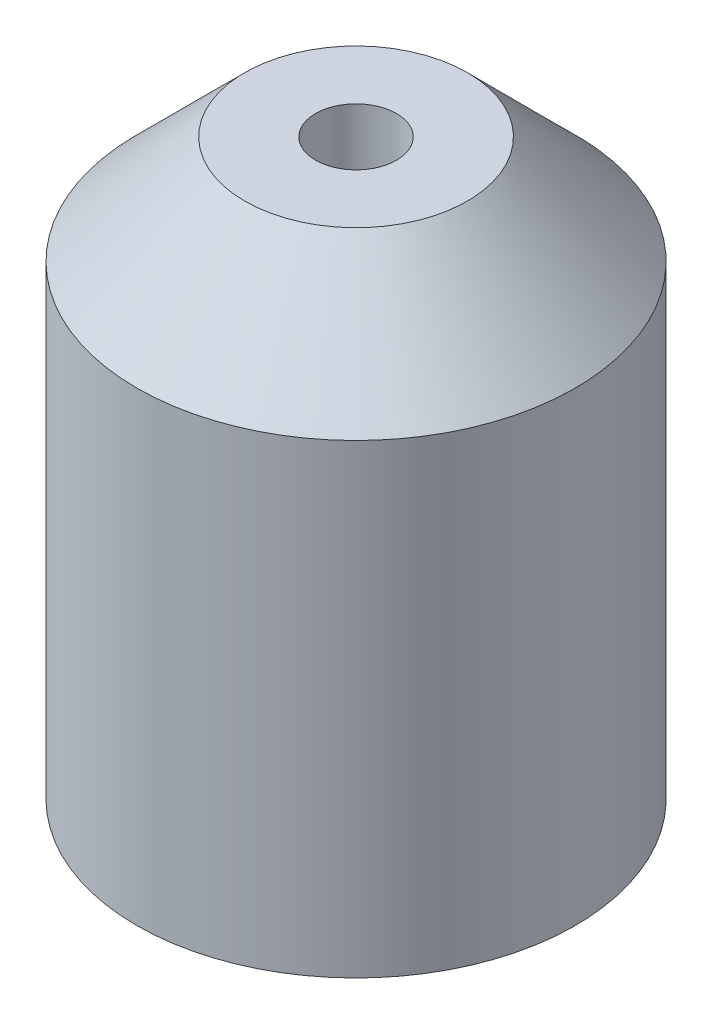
ISO-10303-21;
HEADER;
FILE_DESCRIPTION(('STEP AP214'),'2;1');
FILE_NAME('part.step','',(''),(''),'','','');
FILE_SCHEMA(('AUTOMOTIVE_DESIGN { 1 0 10303 214 1 1 1 1 }'));
ENDSEC;
DATA;
#1=APPLICATION_CONTEXT('core data for automotive mechanical design processes');
#2=APPLICATION_PROTOCOL_DEFINITION('international standard','automotive_design',2000,#1);
#3=PRODUCT_CONTEXT('',#1,'mechanical');
#4=PRODUCT('Part','Part','',(#3));
#5=PRODUCT_RELATED_PRODUCT_CATEGORY('part','',(#4));
#6=PRODUCT_DEFINITION_FORMATION('','',#4);
#7=PRODUCT_DEFINITION_CONTEXT('part definition',#1,'design');
#8=PRODUCT_DEFINITION('design','',#6,#7);
#9=PRODUCT_DEFINITION_SHAPE('','',#8);
#10=(LENGTH_UNIT() NAMED_UNIT(*) SI_UNIT(.MILLI.,.METRE.));
#11=(NAMED_UNIT(*) PLANE_ANGLE_UNIT() SI_UNIT($,.RADIAN.));
#12=(NAMED_UNIT(*) SI_UNIT($,.STERADIAN.) SOLID_ANGLE_UNIT());
#13=UNCERTAINTY_MEASURE_WITH_UNIT(LENGTH_MEASURE(1.E-05),#10,'distance_accuracy_value','');
#14=(GEOMETRIC_REPRESENTATION_CONTEXT(3) GLOBAL_UNCERTAINTY_ASSIGNED_CONTEXT((#13)) GLOBAL_UNIT_ASSIGNED_CONTEXT((#10,
#11,#12)) REPRESENTATION_CONTEXT('',''));
#15=CARTESIAN_POINT('',(0.,0.,0.));
#16=DIRECTION('',(0.,0.,1.));
#17=DIRECTION('',(1.,0.,0.));
#18=AXIS2_PLACEMENT_3D('',#15,#16,#17);
#19=CARTESIAN_POINT('',(0.,0.,43.18));
#20=DIRECTION('',(0.,1.,0.));
#21=DIRECTION('',(0.,0.,1.));
#22=AXIS2_PLACEMENT_3D('',#19,#20,#21);
#23=PLANE('',#22);
#24=CARTESIAN_POINT('',(0.,0.,43.18));
#25=DIRECTION('',(0.,1.,0.));
#26=DIRECTION('',(0.,0.,1.));
#27=AXIS2_PLACEMENT_3D('',#24,#25,#26);
#28=CIRCLE('',#27,14.2269848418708);
#29=CARTESIAN_POINT('',(0.,0.,57.4069848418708));
#30=VERTEX_POINT('',#29);
#31=EDGE_CURVE('E65',#30,#30,#28,.T.);
#32=ORIENTED_EDGE('',*,*,#31,.T.);
#33=EDGE_LOOP('',(#32));
#34=FACE_BOUND('',#33,.T.);
#35=CARTESIAN_POINT('',(0.,0.,43.18));
#36=DIRECTION('',(0.,1.,0.));
#37=DIRECTION('',(0.,0.,1.));
#38=AXIS2_PLACEMENT_3D('',#35,#36,#37);
#39=CIRCLE('',#38,20.6375);
#40=CARTESIAN_POINT('',(0.,0.,63.8175));
#41=VERTEX_POINT('',#40);
#42=EDGE_CURVE('E123',#41,#41,#39,.T.);
#43=ORIENTED_EDGE('',*,*,#42,.F.);
#44=EDGE_LOOP('',(#43));
#45=FACE_BOUND('',#44,.T.);
#46=ADVANCED_FACE('F50',(#34,#45),#23,.F.);
#47=CARTESIAN_POINT('',(0.,53.975,43.18));
#48=DIRECTION('',(0.,-1.,0.));
#49=DIRECTION('',(0.,0.,-1.));
#50=AXIS2_PLACEMENT_3D('',#47,#48,#49);
#51=CYLINDRICAL_SURFACE('',#50,3.81);
#52=CARTESIAN_POINT('',(0.,53.975,43.18));
#53=DIRECTION('',(0.,1.,0.));
#54=DIRECTION('',(0.,0.,1.));
#55=AXIS2_PLACEMENT_3D('',#52,#53,#54);
#56=CIRCLE('',#55,3.81);
#57=CARTESIAN_POINT('',(0.,53.975,46.99));
#58=VERTEX_POINT('',#57);
#59=EDGE_CURVE('E125',#58,#58,#56,.T.);
#60=ORIENTED_EDGE('',*,*,#59,.T.);
#61=EDGE_LOOP('',(#60));
#62=FACE_BOUND('',#61,.T.);
#63=CARTESIAN_POINT('',(0.,45.1885840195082,43.1799999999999));
#64=DIRECTION('',(0.,-1.,0.));
#65=DIRECTION('',(0.,0.,-1.));
#66=AXIS2_PLACEMENT_3D('',#63,#64,#65);
#67=CIRCLE('',#66,3.81);
#68=CARTESIAN_POINT('',(0.,45.1885840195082,39.3699999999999));
#69=VERTEX_POINT('',#68);
#70=EDGE_CURVE('E128',#69,#69,#67,.T.);
#71=ORIENTED_EDGE('',*,*,#70,.T.);
#72=EDGE_LOOP('',(#71));
#73=FACE_BOUND('',#72,.T.);
#74=ADVANCED_FACE('F112',(#62,#73),#51,.F.);
#75=CARTESIAN_POINT('',(0.,53.975,43.18));
#76=DIRECTION('',(0.,1.,0.));
#77=DIRECTION('',(0.,0.,1.));
#78=AXIS2_PLACEMENT_3D('',#75,#76,#77);
#79=PLANE('',#78);
#80=CARTESIAN_POINT('',(0.,53.975,43.18));
#81=DIRECTION('',(0.,1.,0.));
#82=DIRECTION('',(0.,0.,1.));
#83=AXIS2_PLACEMENT_3D('',#80,#81,#82);
#84=CIRCLE('',#83,10.4775);
#85=CARTESIAN_POINT('',(0.,53.975,53.6575));
#86=VERTEX_POINT('',#85);
#87=EDGE_CURVE('E57',#86,#86,#84,.T.);
#88=ORIENTED_EDGE('',*,*,#87,.T.);
#89=EDGE_LOOP('',(#88));
#90=FACE_BOUND('',#89,.T.);
#91=ORIENTED_EDGE('',*,*,#59,.F.);
#92=EDGE_LOOP('',(#91));
#93=FACE_BOUND('',#92,.T.);
#94=ADVANCED_FACE('F101',(#90,#93),#79,.T.);
#95=CARTESIAN_POINT('',(0.,53.975,43.18));
#96=DIRECTION('',(0.,-1.,0.));
#97=DIRECTION('',(0.,0.,-1.));
#98=AXIS2_PLACEMENT_3D('',#95,#96,#97);
#99=CYLINDRICAL_SURFACE('',#98,20.6375);
#100=CARTESIAN_POINT('',(0.,43.815,43.18));
#101=DIRECTION('',(0.,1.,0.));
#102=DIRECTION('',(0.,0.,1.));
#103=AXIS2_PLACEMENT_3D('',#100,#101,#102);
#104=CIRCLE('',#103,20.6375);
#105=CARTESIAN_POINT('',(0.,43.815,63.8175));
#106=VERTEX_POINT('',#105);
#107=EDGE_CURVE('E12',#106,#106,#104,.F.);
#108=ORIENTED_EDGE('',*,*,#107,.T.);
#109=EDGE_LOOP('',(#108));
#110=FACE_BOUND('',#109,.T.);
#111=CARTESIAN_POINT('',(-20.6375,28.4117380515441,43.18));
#112=CARTESIAN_POINT('',(-20.6374961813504,28.4117462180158,42.9679217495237));
#113=CARTESIAN_POINT('',(-20.6341971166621,28.4295054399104,42.7557365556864));
#114=CARTESIAN_POINT('',(-20.6213544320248,28.5000297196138,42.3373413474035));
#115=CARTESIAN_POINT('',(-20.6118054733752,28.5528247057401,42.1311365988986));
#116=CARTESIAN_POINT('',(-20.5875315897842,28.6917522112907,41.7308140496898));
#117=CARTESIAN_POINT('',(-20.572811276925,28.7778550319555,41.5366856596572));
#118=CARTESIAN_POINT('',(-20.539803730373,28.980870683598,41.1656494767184));
#119=CARTESIAN_POINT('',(-20.5215168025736,29.0977808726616,40.9887402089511));
#120=CARTESIAN_POINT('',(-20.4831580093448,29.3605358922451,40.6550884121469));
#121=CARTESIAN_POINT('',(-20.463069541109,29.5066693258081,40.4985750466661));
#122=CARTESIAN_POINT('',(-20.4234955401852,29.8231017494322,40.2121399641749));
#123=CARTESIAN_POINT('',(-20.4040100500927,29.9934024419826,40.0822201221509));
#124=CARTESIAN_POINT('',(-20.3676869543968,30.3549481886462,39.8517118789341));
#125=CARTESIAN_POINT('',(-20.3508707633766,30.5463436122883,39.7513556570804));
#126=CARTESIAN_POINT('',(-20.3220237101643,30.9436396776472,39.5843094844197));
#127=CARTESIAN_POINT('',(-20.3099924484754,31.1495391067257,39.5176167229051));
#128=CARTESIAN_POINT('',(-20.2922443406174,31.5675496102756,39.4205241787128));
#129=CARTESIAN_POINT('',(-20.2864581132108,31.7795649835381,39.3897253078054));
#130=CARTESIAN_POINT('',(-20.2816459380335,32.2058268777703,39.3640562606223));
#131=CARTESIAN_POINT('',(-20.2826194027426,32.42007320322,39.3691829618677));
#132=CARTESIAN_POINT('',(-20.2911534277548,32.8418301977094,39.4148957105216));
#133=CARTESIAN_POINT('',(-20.2986298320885,33.0493919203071,39.4550287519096));
#134=CARTESIAN_POINT('',(-20.3191952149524,33.4547846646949,39.5689018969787));
#135=CARTESIAN_POINT('',(-20.3322844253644,33.6526152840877,39.6426433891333));
#136=CARTESIAN_POINT('',(-20.3626889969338,34.0342600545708,39.8220855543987));
#137=CARTESIAN_POINT('',(-20.380028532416,34.2179858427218,39.9279698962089));
#138=CARTESIAN_POINT('',(-20.4169639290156,34.5652332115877,40.1685621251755));
#139=CARTESIAN_POINT('',(-20.436560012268,34.7287527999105,40.3032728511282));
#140=CARTESIAN_POINT('',(-20.4761676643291,35.0335641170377,40.6001400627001));
#141=CARTESIAN_POINT('',(-20.4961810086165,35.1744783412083,40.7626841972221));
#142=CARTESIAN_POINT('',(-20.534092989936,35.4270948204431,41.1093050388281));
#143=CARTESIAN_POINT('',(-20.5519916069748,35.5387967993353,41.293381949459));
#144=CARTESIAN_POINT('',(-20.5836919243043,35.729870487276,41.6782312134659));
#145=CARTESIAN_POINT('',(-20.597488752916,35.8092037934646,41.8790230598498));
#146=CARTESIAN_POINT('',(-20.6193931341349,35.9329110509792,42.2913942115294));
#147=CARTESIAN_POINT('',(-20.6275012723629,35.9772886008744,42.5029724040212));
#148=CARTESIAN_POINT('',(-20.6370345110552,36.0293011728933,42.9276616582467));
#149=CARTESIAN_POINT('',(-20.6385537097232,36.0374535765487,43.1407073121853));
#150=CARTESIAN_POINT('',(-20.6349975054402,36.0181710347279,43.5651179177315));
#151=CARTESIAN_POINT('',(-20.6299224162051,35.9907377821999,43.7764829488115));
#152=CARTESIAN_POINT('',(-20.613806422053,35.9014928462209,44.1898976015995));
#153=CARTESIAN_POINT('',(-20.6028108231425,35.8399421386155,44.3920054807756));
#154=CARTESIAN_POINT('',(-20.576081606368,35.6844912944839,44.7830332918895));
#155=CARTESIAN_POINT('',(-20.5603476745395,35.5905890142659,44.9719523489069));
#156=CARTESIAN_POINT('',(-20.5256523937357,35.371949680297,45.3334535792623));
#157=CARTESIAN_POINT('',(-20.506658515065,35.2468954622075,45.5058407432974));
#158=CARTESIAN_POINT('',(-20.467636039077,34.9699322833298,45.827368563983));
#159=CARTESIAN_POINT('',(-20.447607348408,34.8180208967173,45.9765071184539));
#160=CARTESIAN_POINT('',(-20.4084615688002,34.4893163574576,46.2492632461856));
#161=CARTESIAN_POINT('',(-20.3893595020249,34.3122285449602,46.3725282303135));
#162=CARTESIAN_POINT('',(-20.3545288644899,33.9395561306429,46.5875616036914));
#163=CARTESIAN_POINT('',(-20.3388001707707,33.7439722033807,46.6793311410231));
#164=CARTESIAN_POINT('',(-20.312614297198,33.3407677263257,46.8282647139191));
#165=CARTESIAN_POINT('',(-20.3021322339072,33.1332093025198,46.8855923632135));
#166=CARTESIAN_POINT('',(-20.2875687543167,32.7111954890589,46.9645210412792));
#167=CARTESIAN_POINT('',(-20.2834866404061,32.4967408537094,46.9861259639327));
#168=CARTESIAN_POINT('',(-20.2822198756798,32.0705523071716,46.9928687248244));
#169=CARTESIAN_POINT('',(-20.2849300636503,31.8588273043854,46.9785625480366));
#170=CARTESIAN_POINT('',(-20.2967097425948,31.4408549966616,46.9151042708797));
#171=CARTESIAN_POINT('',(-20.305779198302,31.2346076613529,46.8659523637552));
#172=CARTESIAN_POINT('',(-20.3292118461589,30.8337322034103,46.7344293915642));
#173=CARTESIAN_POINT('',(-20.3435657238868,30.6390843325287,46.6521167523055));
#174=CARTESIAN_POINT('',(-20.3759568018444,30.2662722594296,46.4566690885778));
#175=CARTESIAN_POINT('',(-20.3939942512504,30.0881091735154,46.3435319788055));
#176=CARTESIAN_POINT('',(-20.4320475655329,29.7505354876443,46.0877065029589));
#177=CARTESIAN_POINT('',(-20.4520883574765,29.5914347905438,45.9446128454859));
#178=CARTESIAN_POINT('',(-20.4917020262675,29.2993171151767,45.6337828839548));
#179=CARTESIAN_POINT('',(-20.5112747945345,29.1663061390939,45.466040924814));
#180=CARTESIAN_POINT('',(-20.5479462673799,28.92906702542,45.1089315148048));
#181=CARTESIAN_POINT('',(-20.5650219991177,28.8250990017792,44.9193888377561));
#182=CARTESIAN_POINT('',(-20.5945513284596,28.6506478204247,44.5252746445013));
#183=CARTESIAN_POINT('',(-20.6070093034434,28.5801329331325,44.3207175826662));
#184=CARTESIAN_POINT('',(-20.6233333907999,28.489051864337,43.9596081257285));
#185=CARTESIAN_POINT('',(-20.6286161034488,28.4601082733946,43.8051782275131));
#186=CARTESIAN_POINT('',(-20.6357007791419,28.4214485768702,43.4938517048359));
#187=CARTESIAN_POINT('',(-20.637502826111,28.4117320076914,43.3369551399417));
#188=CARTESIAN_POINT('',(-20.6375,28.4117380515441,43.18));
#189=B_SPLINE_CURVE_WITH_KNOTS('',3,(#111,#112,#113,#114,#115,#116,#117,#118,#119,#120,#121,
#122,#123,#124,#125,#126,#127,#128,#129,#130,#131,#132,#133,#134,#135,#136,#137,#138,#139,#140,
#141,#142,#143,#144,#145,#146,#147,#148,#149,#150,#151,#152,#153,#154,#155,#156,#157,#158,#159,
#160,#161,#162,#163,#164,#165,#166,#167,#168,#169,#170,#171,#172,#173,#174,#175,#176,#177,#178,
#179,#180,#181,#182,#183,#184,#185,#186,#187,#188),.UNSPECIFIED.,.T.,.F.,(4,2,2,2,2,2,2,2,2,2,2,
2,2,2,2,2,2,2,2,2,2,2,2,2,2,2,2,2,2,2,2,2,2,2,2,2,2,2,4),(0.,0.635660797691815,1.27186529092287,
1.907503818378,2.5430878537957,3.18528982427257,3.82753705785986,4.47470139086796,
5.12181168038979,5.76165624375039,6.40144519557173,7.03307565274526,7.66473220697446,
8.30006833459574,8.93546705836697,9.58056731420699,10.2256736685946,10.8715431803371,
11.5173461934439,12.15389532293,12.7904141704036,13.4221299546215,14.0538876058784,
14.6923608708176,15.330891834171,15.977628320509,16.6243412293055,17.2679571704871,
17.9115029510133,18.5451468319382,19.1787871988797,19.811316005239,20.443887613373,
21.0856456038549,21.7275510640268,22.3750335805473,23.0219007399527,23.4923527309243,
23.9627933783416),.UNSPECIFIED.);
#190=CARTESIAN_POINT('',(-20.6375,28.4117380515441,43.18));
#191=VERTEX_POINT('',#190);
#192=EDGE_CURVE('E75',#191,#191,#189,.T.);
#193=ORIENTED_EDGE('',*,*,#192,.T.);
#194=EDGE_LOOP('',(#193));
#195=FACE_BOUND('',#194,.T.);
#196=ORIENTED_EDGE('',*,*,#42,.T.);
#197=EDGE_LOOP('',(#196));
#198=FACE_BOUND('',#197,.T.);
#199=ADVANCED_FACE('F97',(#110,#195,#198),#99,.T.);
#200=CARTESIAN_POINT('',(0.,0.,43.18));
#201=DIRECTION('',(0.,1.,0.));
#202=DIRECTION('',(0.,0.,1.));
#203=AXIS2_PLACEMENT_3D('',#200,#201,#202);
#204=CYLINDRICAL_SURFACE('',#203,13.49375);
#205=CARTESIAN_POINT('',(-12.944697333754,32.2217380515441,39.3699999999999));
#206=CARTESIAN_POINT('',(-12.9447004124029,32.4311175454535,39.3700040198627));
#207=CARTESIAN_POINT('',(-12.9498329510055,32.6405379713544,39.3873185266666));
#208=CARTESIAN_POINT('',(-12.969737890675,33.0532966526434,39.4559665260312));
#209=CARTESIAN_POINT('',(-12.9845143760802,33.2566322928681,39.5073144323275));
#210=CARTESIAN_POINT('',(-13.0219031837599,33.6511891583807,39.6421791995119));
#211=CARTESIAN_POINT('',(-13.0445035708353,33.8424283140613,39.7256470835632));
#212=CARTESIAN_POINT('',(-13.0949780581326,34.2082272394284,39.9222253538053));
#213=CARTESIAN_POINT('',(-13.1228527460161,34.3827851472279,40.0353390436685));
#214=CARTESIAN_POINT('',(-13.1816110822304,34.7151597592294,40.2913908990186));
#215=CARTESIAN_POINT('',(-13.2125531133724,34.87243960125,40.4350127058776));
#216=CARTESIAN_POINT('',(-13.2734582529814,35.1610313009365,40.7465359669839));
#217=CARTESIAN_POINT('',(-13.3034212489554,35.2923401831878,40.9144401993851));
#218=CARTESIAN_POINT('',(-13.3596491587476,35.5275434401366,41.2735289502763));
#219=CARTESIAN_POINT('',(-13.3858372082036,35.6308978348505,41.4650802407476));
#220=CARTESIAN_POINT('',(-13.430890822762,35.803725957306,41.8637064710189));
#221=CARTESIAN_POINT('',(-13.4497577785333,35.8732061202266,42.0707784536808));
#222=CARTESIAN_POINT('',(-13.4776304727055,35.9745581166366,42.4889581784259));
#223=CARTESIAN_POINT('',(-13.4868756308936,36.0073446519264,42.6998279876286));
#224=CARTESIAN_POINT('',(-13.4953029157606,36.0372631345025,43.1242642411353));
#225=CARTESIAN_POINT('',(-13.494486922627,36.0344017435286,43.3378301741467));
#226=CARTESIAN_POINT('',(-13.4830564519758,35.9937359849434,43.7552067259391));
#227=CARTESIAN_POINT('',(-13.4727193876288,35.9569208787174,43.959122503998));
#228=CARTESIAN_POINT('',(-13.4437400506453,35.8509990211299,44.3577544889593));
#229=CARTESIAN_POINT('',(-13.4250972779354,35.7818903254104,44.5524701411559));
#230=CARTESIAN_POINT('',(-13.3812026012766,35.6126257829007,44.9296201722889));
#231=CARTESIAN_POINT('',(-13.3558817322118,35.5121438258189,45.1118998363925));
#232=CARTESIAN_POINT('',(-13.3013400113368,35.2832386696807,45.4573382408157));
#233=CARTESIAN_POINT('',(-13.2721183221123,35.1548094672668,45.6204928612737));
#234=CARTESIAN_POINT('',(-13.2117410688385,34.8684579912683,45.9289558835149));
#235=CARTESIAN_POINT('',(-13.1805535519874,34.7096751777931,46.0734601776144));
#236=CARTESIAN_POINT('',(-13.120651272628,34.3698141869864,46.3340005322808));
#237=CARTESIAN_POINT('',(-13.09193670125,34.1887342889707,46.4500343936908));
#238=CARTESIAN_POINT('',(-13.0400914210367,33.8075067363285,46.6510533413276));
#239=CARTESIAN_POINT('',(-13.0170050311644,33.607224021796,46.7357945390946));
#240=CARTESIAN_POINT('',(-12.9795674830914,33.1944349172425,46.8701266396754));
#241=CARTESIAN_POINT('',(-12.9652138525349,32.9819320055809,46.9197274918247));
#242=CARTESIAN_POINT('',(-12.9474011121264,32.5583164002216,46.9809318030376));
#243=CARTESIAN_POINT('',(-12.9435952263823,32.3473929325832,46.993745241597));
#244=CARTESIAN_POINT('',(-12.9463554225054,31.9264118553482,46.9843655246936));
#245=CARTESIAN_POINT('',(-12.9529202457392,31.7163541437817,46.9621766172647));
#246=CARTESIAN_POINT('',(-12.9753446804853,31.3079024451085,46.8844939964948));
#247=CARTESIAN_POINT('',(-12.9909945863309,31.1093530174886,46.8297510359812));
#248=CARTESIAN_POINT('',(-13.0296152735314,30.7242607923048,46.6893703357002));
#249=CARTESIAN_POINT('',(-13.0525870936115,30.5377197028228,46.6037282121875));
#250=CARTESIAN_POINT('',(-13.1039569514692,30.17694149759,46.4015982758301));
#251=CARTESIAN_POINT('',(-13.13247307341,30.0031124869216,46.2844127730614));
#252=CARTESIAN_POINT('',(-13.191451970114,29.6771427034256,46.0233705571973));
#253=CARTESIAN_POINT('',(-13.2219151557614,29.5250065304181,45.8795082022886));
#254=CARTESIAN_POINT('',(-13.2825680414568,29.2415958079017,45.5635568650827));
#255=CARTESIAN_POINT('',(-13.3127158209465,29.1111715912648,45.3906953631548));
#256=CARTESIAN_POINT('',(-13.3683221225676,28.8811782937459,45.0248404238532));
#257=CARTESIAN_POINT('',(-13.3937808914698,28.7816075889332,44.8318480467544));
#258=CARTESIAN_POINT('',(-13.4369777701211,28.6170935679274,44.4325536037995));
#259=CARTESIAN_POINT('',(-13.4547741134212,28.5518881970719,44.2263661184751));
#260=CARTESIAN_POINT('',(-13.4808980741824,28.4572298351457,43.8053755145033));
#261=CARTESIAN_POINT('',(-13.4892280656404,28.4277678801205,43.5905745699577));
#262=CARTESIAN_POINT('',(-13.4953537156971,28.4060499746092,43.1663577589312));
#263=CARTESIAN_POINT('',(-13.4935006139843,28.4125535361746,42.9570096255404));
#264=CARTESIAN_POINT('',(-13.4802779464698,28.4596628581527,42.5425100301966));
#265=CARTESIAN_POINT('',(-13.468908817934,28.5002670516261,42.3373583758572));
#266=CARTESIAN_POINT('',(-13.4380156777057,28.6136913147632,41.9387575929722));
#267=CARTESIAN_POINT('',(-13.4185622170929,28.6862329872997,41.7452234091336));
#268=CARTESIAN_POINT('',(-13.3735227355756,28.8612254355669,41.3729653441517));
#269=CARTESIAN_POINT('',(-13.3479357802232,28.9636807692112,41.1942437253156));
#270=CARTESIAN_POINT('',(-13.2924139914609,29.1990717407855,40.8510202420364));
#271=CARTESIAN_POINT('',(-13.2623740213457,29.3328100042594,40.6870859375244));
#272=CARTESIAN_POINT('',(-13.2017145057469,29.625483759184,40.3835686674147));
#273=CARTESIAN_POINT('',(-13.171094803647,29.7844261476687,40.2439923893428));
#274=CARTESIAN_POINT('',(-13.1118348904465,30.1278632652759,39.989607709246));
#275=CARTESIAN_POINT('',(-13.0832649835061,30.3129058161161,39.8755208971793));
#276=CARTESIAN_POINT('',(-13.0323877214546,30.7003282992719,39.6802274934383));
#277=CARTESIAN_POINT('',(-13.0100767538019,30.9026981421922,39.5990019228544));
#278=CARTESIAN_POINT('',(-12.9769409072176,31.2901913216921,39.4808774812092));
#279=CARTESIAN_POINT('',(-12.964954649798,31.4738321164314,39.4394034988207));
#280=CARTESIAN_POINT('',(-12.9488320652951,31.845550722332,39.3839650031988));
#281=CARTESIAN_POINT('',(-12.9446945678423,32.0336278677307,39.3699963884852));
#282=CARTESIAN_POINT('',(-12.944697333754,32.2217380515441,39.3699999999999));
#283=B_SPLINE_CURVE_WITH_KNOTS('',3,(#205,#206,#207,#208,#209,#210,#211,#212,#213,#214,#215,
#216,#217,#218,#219,#220,#221,#222,#223,#224,#225,#226,#227,#228,#229,#230,#231,#232,#233,#234,
#235,#236,#237,#238,#239,#240,#241,#242,#243,#244,#245,#246,#247,#248,#249,#250,#251,#252,#253,
#254,#255,#256,#257,#258,#259,#260,#261,#262,#263,#264,#265,#266,#267,#268,#269,#270,#271,#272,
#273,#274,#275,#276,#277,#278,#279,#280,#281,#282),.UNSPECIFIED.,.T.,.F.,(4,2,2,2,2,2,2,2,2,2,2,
2,2,2,2,2,2,2,2,2,2,2,2,2,2,2,2,2,2,2,2,2,2,2,2,2,2,2,4),(0.,0.627445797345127,1.25515749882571,
1.88191582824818,2.50874403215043,3.15146962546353,3.79426881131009,4.4487178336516,
5.10304248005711,5.74066515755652,6.37816868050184,6.997665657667,7.61719993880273,
8.24340133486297,8.86973737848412,9.51755745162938,10.1654275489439,10.8182454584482,
11.4708784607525,12.1017850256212,12.7326150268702,13.3494323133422,13.9663371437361,
14.598202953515,15.2302025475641,15.8829808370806,16.5357247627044,17.183416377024,
17.8309455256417,18.4562831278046,19.081591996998,19.7015547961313,20.3216121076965,
20.9597740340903,21.5981108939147,22.252710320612,22.9069311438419,23.4707234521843,
24.0344316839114),.UNSPECIFIED.);
#284=CARTESIAN_POINT('',(-12.944697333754,32.2217380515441,39.3699999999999));
#285=VERTEX_POINT('',#284);
#286=EDGE_CURVE('E68',#285,#285,#283,.T.);
#287=ORIENTED_EDGE('',*,*,#286,.F.);
#288=EDGE_LOOP('',(#287));
#289=FACE_BOUND('',#288,.T.);
#290=CARTESIAN_POINT('',(0.,1.27000000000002,43.18));
#291=DIRECTION('',(0.,1.,0.));
#292=DIRECTION('',(0.,0.,1.));
#293=AXIS2_PLACEMENT_3D('',#290,#291,#292);
#294=CIRCLE('',#293,13.49375);
#295=CARTESIAN_POINT('',(0.,1.27000000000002,56.6737499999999));
#296=VERTEX_POINT('',#295);
#297=EDGE_CURVE('E61',#296,#296,#294,.F.);
#298=ORIENTED_EDGE('',*,*,#297,.T.);
#299=EDGE_LOOP('',(#298));
#300=FACE_BOUND('',#299,.T.);
#301=CARTESIAN_POINT('',(0.,39.37,43.1799999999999));
#302=DIRECTION('',(0.,1.,0.));
#303=DIRECTION('',(0.,0.,1.));
#304=AXIS2_PLACEMENT_3D('',#301,#302,#303);
#305=CIRCLE('',#304,13.4937499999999);
#306=CARTESIAN_POINT('',(0.,39.37,29.68625));
#307=VERTEX_POINT('',#306);
#308=EDGE_CURVE('E95',#307,#307,#305,.T.);
#309=ORIENTED_EDGE('',*,*,#308,.T.);
#310=EDGE_LOOP('',(#309));
#311=FACE_BOUND('',#310,.T.);
#312=ADVANCED_FACE('F77',(#289,#300,#311),#204,.F.);
#313=CARTESIAN_POINT('',(0.,39.37,43.1799999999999));
#314=DIRECTION('',(0.,-1.,0.));
#315=DIRECTION('',(0.,0.,-1.));
#316=AXIS2_PLACEMENT_3D('',#313,#314,#315);
#317=CONICAL_SURFACE('',#316,13.4937499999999,1.02974425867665);
#318=CARTESIAN_POINT('',(0.,45.1885840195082,39.3699999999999));
#319=CARTESIAN_POINT('',(0.,45.127973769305,39.2691276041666));
#320=CARTESIAN_POINT('',(0.,45.0673635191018,39.1682552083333));
#321=CARTESIAN_POINT('',(0.,44.9461430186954,38.9665104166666));
#322=CARTESIAN_POINT('',(0.,44.8855327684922,38.8656380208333));
#323=CARTESIAN_POINT('',(0.,44.7643122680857,38.6638932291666));
#324=CARTESIAN_POINT('',(0.,44.7037020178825,38.5630208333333));
#325=CARTESIAN_POINT('',(0.,44.5824815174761,38.3612760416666));
#326=CARTESIAN_POINT('',(0.,44.5218712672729,38.2604036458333));
#327=CARTESIAN_POINT('',(0.,44.4006507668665,38.0586588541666));
#328=CARTESIAN_POINT('',(0.,44.3400405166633,37.9577864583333));
#329=CARTESIAN_POINT('',(0.,44.2188200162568,37.7560416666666));
#330=CARTESIAN_POINT('',(0.,44.1582097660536,37.6551692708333));
#331=CARTESIAN_POINT('',(0.,44.0369892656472,37.4534244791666));
#332=CARTESIAN_POINT('',(0.,43.976379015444,37.3525520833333));
#333=CARTESIAN_POINT('',(0.,43.8551585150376,37.1508072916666));
#334=CARTESIAN_POINT('',(0.,43.7945482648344,37.0499348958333));
#335=CARTESIAN_POINT('',(0.,43.673327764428,36.8481901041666));
#336=CARTESIAN_POINT('',(0.,43.6127175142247,36.7473177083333));
#337=CARTESIAN_POINT('',(0.,43.4914970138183,36.5455729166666));
#338=CARTESIAN_POINT('',(0.,43.4308867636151,36.4447005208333));
#339=CARTESIAN_POINT('',(0.,43.3096662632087,36.2429557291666));
#340=CARTESIAN_POINT('',(0.,43.2490560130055,36.1420833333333));
#341=CARTESIAN_POINT('',(0.,43.1278355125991,35.9403385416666));
#342=CARTESIAN_POINT('',(0.,43.0672252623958,35.8394661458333));
#343=CARTESIAN_POINT('',(0.,42.9460047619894,35.6377213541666));
#344=CARTESIAN_POINT('',(0.,42.8853945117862,35.5368489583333));
#345=CARTESIAN_POINT('',(0.,42.7641740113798,35.3351041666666));
#346=CARTESIAN_POINT('',(0.,42.7035637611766,35.2342317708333));
#347=CARTESIAN_POINT('',(0.,42.5823432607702,35.0324869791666));
#348=CARTESIAN_POINT('',(0.,42.5217330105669,34.9316145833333));
#349=CARTESIAN_POINT('',(0.,42.4005125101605,34.7298697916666));
#350=CARTESIAN_POINT('',(0.,42.3399022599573,34.6289973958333));
#351=CARTESIAN_POINT('',(0.,42.2186817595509,34.4272526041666));
#352=CARTESIAN_POINT('',(0.,42.1580715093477,34.3263802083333));
#353=CARTESIAN_POINT('',(0.,42.0368510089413,34.1246354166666));
#354=CARTESIAN_POINT('',(0.,41.9762407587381,34.0237630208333));
#355=CARTESIAN_POINT('',(0.,41.8550202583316,33.8220182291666));
#356=CARTESIAN_POINT('',(0.,41.7944100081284,33.7211458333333));
#357=CARTESIAN_POINT('',(0.,41.673189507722,33.5194010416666));
#358=CARTESIAN_POINT('',(0.,41.6125792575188,33.4185286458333));
#359=CARTESIAN_POINT('',(0.,41.4913587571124,33.2167838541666));
#360=CARTESIAN_POINT('',(0.,41.4307485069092,33.1159114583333));
#361=CARTESIAN_POINT('',(0.,41.3095280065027,32.9141666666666));
#362=CARTESIAN_POINT('',(0.,41.2489177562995,32.8132942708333));
#363=CARTESIAN_POINT('',(0.,41.1276972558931,32.6115494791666));
#364=CARTESIAN_POINT('',(0.,41.0670870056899,32.5106770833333));
#365=CARTESIAN_POINT('',(0.,40.9458665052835,32.3089322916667));
#366=CARTESIAN_POINT('',(0.,40.8852562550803,32.2080598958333));
#367=CARTESIAN_POINT('',(0.,40.7640357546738,32.0063151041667));
#368=CARTESIAN_POINT('',(0.,40.7034255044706,31.9054427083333));
#369=CARTESIAN_POINT('',(0.,40.5822050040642,31.7036979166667));
#370=CARTESIAN_POINT('',(0.,40.521594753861,31.6028255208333));
#371=CARTESIAN_POINT('',(0.,40.4003742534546,31.4010807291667));
#372=CARTESIAN_POINT('',(0.,40.3397640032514,31.3002083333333));
#373=CARTESIAN_POINT('',(0.,40.218543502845,31.0984635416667));
#374=CARTESIAN_POINT('',(0.,40.1579332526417,30.9975911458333));
#375=CARTESIAN_POINT('',(0.,40.0367127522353,30.7958463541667));
#376=CARTESIAN_POINT('',(0.,39.9761025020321,30.6949739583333));
#377=CARTESIAN_POINT('',(0.,39.8548820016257,30.4932291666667));
#378=CARTESIAN_POINT('',(0.,39.7942717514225,30.3923567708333));
#379=CARTESIAN_POINT('',(0.,39.673051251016,30.1906119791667));
#380=CARTESIAN_POINT('',(0.,39.6124410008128,30.0897395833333));
#381=CARTESIAN_POINT('',(0.,39.4912205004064,29.8879947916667));
#382=CARTESIAN_POINT('',(0.,39.4306102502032,29.7871223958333));
#383=CARTESIAN_POINT('',(0.,39.37,29.68625));
#384=B_SPLINE_CURVE_WITH_KNOTS('',3,(#318,#319,#320,#321,#322,#323,#324,#325,#326,#327,#328,
#329,#330,#331,#332,#333,#334,#335,#336,#337,#338,#339,#340,#341,#342,#343,#344,#345,#346,#347,
#348,#349,#350,#351,#352,#353,#354,#355,#356,#357,#358,#359,#360,#361,#362,#363,#364,#365,#366,
#367,#368,#369,#370,#371,#372,#373,#374,#375,#376,#377,#378,#379,#380,#381,#382,#383),
.UNSPECIFIED.,.F.,.F.,(4,2,2,2,2,2,2,2,2,2,2,2,2,2,2,2,2,2,2,2,2,2,2,2,2,2,2,2,2,2,2,2,4),(0.,
0.353043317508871,0.706086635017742,1.05912995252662,1.41217327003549,1.76521658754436,
2.11825990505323,2.47130322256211,2.82434654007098,3.17738985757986,3.53043317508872,
3.8834764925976,4.23651981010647,4.58956312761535,4.94260644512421,5.29564976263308,
5.64869308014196,6.00173639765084,6.3547797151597,6.70782303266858,7.06086635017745,
7.41390966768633,7.7669529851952,8.11999630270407,8.47303962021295,8.82608293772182,
9.17912625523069,9.53216957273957,9.88521289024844,10.2382562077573,10.5912995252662,
10.9443428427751,11.2973861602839),.UNSPECIFIED.);
#385=EDGE_CURVE('BSEAM86',#69,#307,#384,.T.);
#386=ORIENTED_EDGE('',*,*,#70,.F.);
#387=ORIENTED_EDGE('',*,*,#308,.F.);
#388=ORIENTED_EDGE('',*,*,#385,.T.);
#389=ORIENTED_EDGE('',*,*,#385,.F.);
#390=EDGE_LOOP('',(#386,#388,#387,#389));
#391=FACE_BOUND('',#390,.T.);
#392=ADVANCED_FACE('F86',(#391),#317,.F.);
#393=CARTESIAN_POINT('',(0.,0.,43.18));
#394=DIRECTION('',(0.,-1.,0.));
#395=DIRECTION('',(0.,0.,-1.));
#396=AXIS2_PLACEMENT_3D('',#393,#394,#395);
#397=CONICAL_SURFACE('',#396,14.2269848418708,0.523598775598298);
#398=ORIENTED_EDGE('',*,*,#297,.F.);
#399=EDGE_LOOP('',(#398));
#400=FACE_BOUND('',#399,.T.);
#401=ORIENTED_EDGE('',*,*,#31,.F.);
#402=EDGE_LOOP('',(#401));
#403=FACE_BOUND('',#402,.T.);
#404=ADVANCED_FACE('F84',(#400,#403),#397,.F.);
#405=CARTESIAN_POINT('',(-20.6375,32.2217380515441,43.1799999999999));
#406=DIRECTION('',(1.,0.,0.));
#407=DIRECTION('',(0.,0.,-1.));
#408=AXIS2_PLACEMENT_3D('',#405,#406,#407);
#409=CYLINDRICAL_SURFACE('',#408,3.81);
#410=ORIENTED_EDGE('',*,*,#286,.T.);
#411=EDGE_LOOP('',(#410));
#412=FACE_BOUND('',#411,.T.);
#413=ORIENTED_EDGE('',*,*,#192,.F.);
#414=EDGE_LOOP('',(#413));
#415=FACE_BOUND('',#414,.T.);
#416=ADVANCED_FACE('F81',(#412,#415),#409,.F.);
#417=CARTESIAN_POINT('',(0.,53.975,43.18));
#418=DIRECTION('',(0.,-1.,0.));
#419=DIRECTION('',(0.,0.,-1.));
#420=AXIS2_PLACEMENT_3D('',#417,#418,#419);
#421=CONICAL_SURFACE('',#420,10.4775,0.785398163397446);
#422=ORIENTED_EDGE('',*,*,#107,.F.);
#423=EDGE_LOOP('',(#422));
#424=FACE_BOUND('',#423,.T.);
#425=ORIENTED_EDGE('',*,*,#87,.F.);
#426=EDGE_LOOP('',(#425));
#427=FACE_BOUND('',#426,.T.);
#428=ADVANCED_FACE('F52',(#424,#427),#421,.T.);
#429=CLOSED_SHELL('',(#46,#74,#94,#199,#312,#392,#404,#416,#428));
#430=MANIFOLD_SOLID_BREP('B2',#429);
#431=ADVANCED_BREP_SHAPE_REPRESENTATION('',(#18,#430),#14);
#432=SHAPE_DEFINITION_REPRESENTATION(#9,#431);
ENDSEC;
END-ISO-10303-21;
